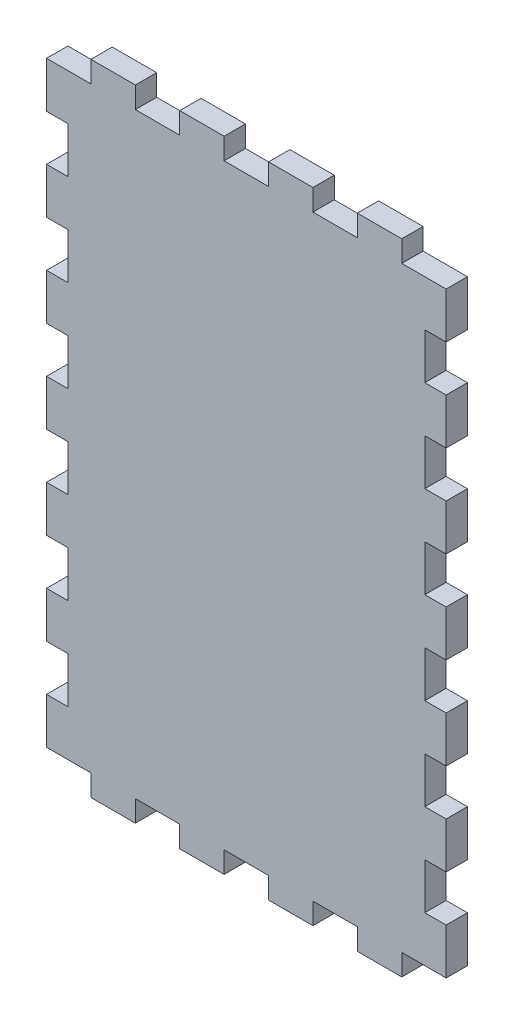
from build123d import *

# Parameters (mm, degrees)
BOSS_EXTRUDE1_DEPTH = 4


with BuildPart() as part:
    # Model → Boss-Extrude1 (new body)
    with BuildSketch(Plane.XY):
        Polygon((0, 83), (0, 91.61), (4, 91.61), (4, 100.23), (0, 100.23), (0, 108.85), (4, 108.85), (4, 117.46), (0, 117.46), (0, 126.08), (4, 126.08), (4, 134.69), (0, 134.69), (0, 143.31), (4, 143.31), (4, 151.92), (0, 151.92), (0, 160.54), (4, 160.54), (4, 169.15), (0, 169.15), (0, 177.77), (4, 177.77), (4, 186.38), (0, 186.38), (0, 195), (8.33, 195), (8.33, 199), (16.67, 199), (16.67, 195), (25, 195), (25, 199), (33.33, 199), (33.33, 195), (41.67, 195), (41.67, 199), (50, 199), (50, 195), (58.33, 195), (58.33, 199), (66.67, 199), (66.67, 195), (75, 195), (75, 186.38), (71, 186.38), (71, 177.77), (75, 177.77), (75, 169.15), (71, 169.15), (71, 160.54), (75, 160.54), (75, 151.92), (71, 151.92), (71, 143.31), (75, 143.31), (75, 134.69), (71, 134.69), (71, 126.08), (75, 126.08), (75, 117.46), (71, 117.46), (71, 108.85), (75, 108.85), (75, 100.23), (71, 100.23), (71, 91.61), (75, 91.61), (75, 83), (66.67, 83), (66.67, 79), (58.33, 79), (58.33, 83), (50, 83), (50, 79), (41.67, 79), (41.67, 83), (33.33, 83), (33.33, 79), (25, 79), (25, 83), (16.67, 83), (16.67, 79), (8.33, 79), (8.33, 83), align=None)
    extrude(amount=BOSS_EXTRUDE1_DEPTH)


solid = part.part
